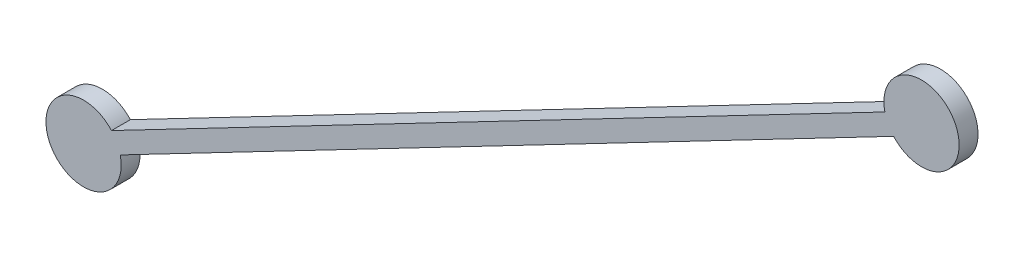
from build123d import *

# Parameters (mm, degrees)
BASE_EXTRUSION_DEPTH = 2


with BuildPart() as part:
    # Esquisse1 → Base-Extrusion (new body)
    with BuildSketch(Plane.XY):
        with BuildLine():
            Line((349.111622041, 286.809888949), (430.967197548, 329.441645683))
            ThreePointArc((430.967197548, 329.441645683), (437.454899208, 333.948046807), (430.043351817, 331.215485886))
            Line((430.043351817, 331.215485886), (348.18777631, 288.583729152))
            ThreePointArc((348.18777631, 288.583729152), (341.70007465, 284.077328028), (349.111622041, 286.809888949))
        make_face()
    extrude(amount=-BASE_EXTRUSION_DEPTH)


solid = part.part
